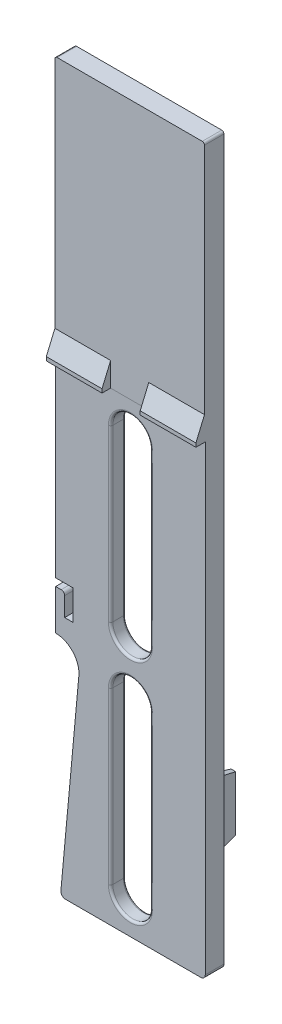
from build123d import *

# Parameters (mm, degrees)
SKETCH1_W                       = 25.4
SKETCH1_H                       = 123.19
BOSS_EXTRUDE1_DEPTH             = 2.032
SKETCH2_W                       = 25.4
SKETCH2_H                       = 123.19
SKETCH2_W_2                     = 22.352
SKETCH2_H_2                     = 120.142
EXTRUDE_THIN1_DEPTH             = 1.143
CUT_EXTRUDE1_DEPTH              = 124.883601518
LPATTERN1_COUNT                 = 2
LPATTERN1_PITCH                 = 38.608
CUT_EXTRUDE2_DEPTH              = 124.883601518
CUT_EXTRUDE2_DEPTH_BACK         = 124.883601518
CUT_EXTRUDE3_DEPTH              = 124.883601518
BOSS_EXTRUDE2_DEPTH             = 1.143
SKETCH7_W                       = 13.647669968
SKETCH7_H                       = 4.198946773
CUT_EXTRUDE4_DEPTH              = 124.883601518
CUT_EXTRUDE5_START              = -1.143
SKETCH8_R                       = 7.1374
CUT_EXTRUDE5_DEPTH              = 1.143
FILLET1_R                       = 0.254
BOSS_EXTRUDE3_DEPTH             = 0.508
BOSS_EXTRUDE4_START             = 1.143
BOSS_EXTRUDE4_DEPTH             = 1.143
SKETCH11_W                      = 1.651
SKETCH11_H                      = 49.0474
BOSS_EXTRUDE5_DEPTH             = 1.143
SKETCH12_W                      = 1.651
SKETCH12_H                      = 41.14187935
EXTRUDE_THIN4_DEPTH             = 1.143
SKETCH13_R                      = 1.392650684
SKETCH13_R_2                    = 1.442552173
BOSS_EXTRUDE6_DEPTH             = 1.143
BOSS_EXTRUDE7_DEPTH             = 1.143
FILLET2_R                       = 0.381
SKETCH15_W                      = 25.4
SKETCH15_H                      = 44.069
BOSS_EXTRUDE8_DEPTH             = 0.127
BOSS_EXTRUDE9_REACH             = 125.884
BOSS_EXTRUDE9_DIRECTION_2_REACH = 125.884
SKETCH17_W                      = 6.477
SKETCH17_H                      = 6.214678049
CUT_EXTRUDE6_DEPTH              = 124.883601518
FILLET3_R                       = 0.5842
SKETCH18_W                      = 1.651
SKETCH18_H                      = 12.7
BOSS_EXTRUDE11_DEPTH            = 6.35
BOSS_EXTRUDE11_TAPER            = 4
CUT_EXTRUDE7_DEPTH              = 127.141435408
FILLET4_R                       = 0.762
FILLET5_R                       = 0.381
CUT_EXTRUDE8_DEPTH              = 125.208662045
CUT_EXTRUDE8_DEPTH_BACK         = 125.208662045


with BuildPart() as part:
    # Sketch1 → Boss-Extrude1 (new body)
    with BuildSketch(Plane.XY):
        with Locations((0, 61.595)):
            Rectangle(SKETCH1_W, SKETCH1_H)
    extrude(amount=-BOSS_EXTRUDE1_DEPTH)

    # Sketch2 → Extrude-Thin1 (add)
    with BuildSketch(Plane(origin=(0, 0, -2.032), x_dir=(-1, 0, 0), z_dir=(0, 0, -1))):
        with Locations((0, 61.595)):
            Rectangle(SKETCH2_W, SKETCH2_H)
        with Locations((0, 61.595)):
            Rectangle(SKETCH2_W_2, SKETCH2_H_2, mode=Mode.SUBTRACT)
    extrude(amount=EXTRUDE_THIN1_DEPTH)

    # Sketch3 → Cut-Extrude1 (cut, through all)
    with BuildSketch(Plane.XY):
        with BuildLine():
            Line((3.3655, 34.7345), (3.3655, 5.8293))
            ThreePointArc((3.3655, 5.8293), (0, 2.4638), (-3.3655, 5.8293))
            Line((-3.3655, 5.8293), (-3.3655, 34.7345))
            ThreePointArc((-3.3655, 34.7345), (0, 38.1), (3.3655, 34.7345))
        make_face()
    cut_extrude1 = extrude(amount=-CUT_EXTRUDE1_DEPTH, mode=Mode.SUBTRACT)

    # LPattern1: Cut-Extrude1 ×2
    with Locations(*[(0, i * LPATTERN1_PITCH, 0) for i in range(1, LPATTERN1_COUNT)]):
        add(cut_extrude1, mode=Mode.SUBTRACT)

    # Sketch4 → Cut-Extrude2 (cut, two sides: drawn at the far end of the back side and taken through both)
    with BuildSketch(Plane.XY.offset(-CUT_EXTRUDE2_DEPTH_BACK)):
        with BuildLine():
            Line((-35.799894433, -260.142646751), (-11.8872, 0))
            Line((-11.8872, 0), (-8.763, 33.987707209))
            ThreePointArc((-8.763, 33.987707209), (-9.7792361, 37.014198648), (-12.7, 38.3032))
            Line((-12.7, 38.3032), (-273.939379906, 38.3032))
            Line((-273.939379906, 38.3032), (-682.338410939, -287.571447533))
            Line((-682.338410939, -287.571447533), (-444.198925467, -586.017294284))
            Line((-444.198925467, -586.017294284), (-35.799894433, -260.142646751))
        make_face()
    extrude(amount=CUT_EXTRUDE2_DEPTH + CUT_EXTRUDE2_DEPTH_BACK, mode=Mode.SUBTRACT)

    # Sketch5 → Cut-Extrude3 (cut, through all)
    with BuildSketch(Plane.XY):
        Polygon((-12.7, 46.4312), (-9.7282, 46.4312), (-9.7282, 41.3512), (-11.176, 41.3512), (-11.176, 45.1612), (-12.7, 45.1612), align=None)
    extrude(amount=-CUT_EXTRUDE3_DEPTH, mode=Mode.SUBTRACT)

    # Sketch6 → Boss-Extrude2 (add)
    with BuildSketch(Plane(origin=(0, 0, -2.032), x_dir=(-1, 0, 0), z_dir=(0, 0, -1))):
        with BuildLine():
            Line((-8.7884, 6.08076), (-8.7884, 72.6186))
            ThreePointArc((-8.7884, 72.6186), (0, 81.407), (8.7884, 72.6186))
            Line((8.7884, 72.6186), (8.7884, 6.08076))
            ThreePointArc((8.7884, 6.08076), (0, -2.70764), (-8.7884, 6.08076))
        make_face()
        with BuildLine():
            Line((-7.1374, 6.08076), (-7.1374, 72.6186))
            ThreePointArc((-7.1374, 72.6186), (0, 79.756), (7.1374, 72.6186))
            Line((7.1374, 72.6186), (7.1374, 6.08076))
            ThreePointArc((7.1374, 6.08076), (0, -1.05664), (-7.1374, 6.08076))
        make_face(mode=Mode.SUBTRACT)
    extrude(amount=BOSS_EXTRUDE2_DEPTH)

    # Sketch7 → Cut-Extrude4 (cut, through all)
    with BuildSketch(Plane(origin=(0, 0, -3.175), x_dir=(-1, 0, 0), z_dir=(0, 0, -1))):
        with Locations((0.47873196, -2.099473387)):
            Rectangle(SKETCH7_W, SKETCH7_H)
    extrude(amount=-CUT_EXTRUDE4_DEPTH, mode=Mode.SUBTRACT)

    # Sketch8 → Cut-Extrude5 (cut)
    with BuildSketch(Plane(origin=(0, 0, -3.175), x_dir=(-1, 0, 0), z_dir=(0, 0, -1)).offset(CUT_EXTRUDE5_START)):
        with Locations((0, 6.08076)):
            Circle(SKETCH8_R)
    extrude(amount=CUT_EXTRUDE5_DEPTH, mode=Mode.SUBTRACT)

    # Fillet1
    fillet1_edges = [part.edges().sort_by_distance(p)[0] for p in [
        (-3.737223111, 0, -2.6035),
        (3.737223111, 0, -2.6035),
    ]]
    fillet(fillet1_edges, radius=FILLET1_R)

    # Sketch9 → Boss-Extrude3 (add)
    with BuildSketch(Plane(origin=(0, 0, -2.032), x_dir=(-1, 0, 0), z_dir=(0, 0, -1))):
        with BuildLine():
            Line((-7.1374, 72.6186), (-7.1374, 6.08076))
            ThreePointArc((-7.1374, 6.08076), (-6.414276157, 2.950338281), (-4.391430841, 0.454232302))
            ThreePointArc((-4.391430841, 0.454232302), (-4.307527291, 0.171365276), (-4.547709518, 0))
            Line((-4.547709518, 0), (4.547709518, 0))
            ThreePointArc((4.547709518, 0), (4.307527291, 0.171365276), (4.391430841, 0.454232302))
            ThreePointArc((4.391430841, 0.454232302), (6.414276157, 2.950338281), (7.1374, 6.08076))
            Line((7.1374, 6.08076), (7.1374, 72.6186))
            ThreePointArc((7.1374, 72.6186), (0, 79.756), (-7.1374, 72.6186))
        make_face()
        with BuildLine():
            Line((3.3655, 34.7345), (3.3655, 5.8293))
            ThreePointArc((3.3655, 5.8293), (0, 2.4638), (-3.3655, 5.8293))
            Line((-3.3655, 5.8293), (-3.3655, 34.7345))
            ThreePointArc((-3.3655, 34.7345), (0, 38.1), (3.3655, 34.7345))
        make_face(mode=Mode.SUBTRACT)
        with BuildLine():
            Line((-3.3655, 44.4373), (-3.3655, 73.3425))
            ThreePointArc((-3.3655, 73.3425), (0, 76.708), (3.3655, 73.3425))
            Line((3.3655, 73.3425), (3.3655, 44.4373))
            ThreePointArc((3.3655, 44.4373), (0, 41.0718), (-3.3655, 44.4373))
        make_face(mode=Mode.SUBTRACT)
    extrude(amount=BOSS_EXTRUDE3_DEPTH)

    # Sketch10 → Boss-Extrude4 (add)
    with BuildSketch(Plane(origin=(0, 0, -2.032), x_dir=(-1, 0, 0), z_dir=(0, 0, -1)).offset(BOSS_EXTRUDE4_START)):
        with BuildLine():
            Line((8.7884, 34.924338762), (8.7884, 48.0822))
            Line((8.7884, 48.0822), (11.176, 48.0822))
            Line((11.176, 48.0822), (11.176, 46.4312))
            Line((11.176, 46.4312), (9.7282, 46.4312))
            Line((9.7282, 46.4312), (9.7282, 41.3512))
            Line((9.7282, 41.3512), (11.176, 41.3512))
            Line((11.176, 41.3512), (11.176, 37.997664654))
            ThreePointArc((11.176, 37.997664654), (9.577858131, 36.775126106), (8.7884, 34.924338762))
        make_face()
    extrude(amount=-BOSS_EXTRUDE4_DEPTH)

    # Sketch11 → Boss-Extrude5 (add)
    with BuildSketch(Plane(origin=(0, 0, -2.032), x_dir=(-1, 0, 0), z_dir=(0, 0, -1))):
        with Locations((7.9629, 97.1423)):
            Rectangle(SKETCH11_W, SKETCH11_H)
        with Locations((-7.9629, 97.1423)):
            Rectangle(SKETCH11_W, SKETCH11_H)
    extrude(amount=BOSS_EXTRUDE5_DEPTH)

    # Sketch12 → Extrude-Thin4 (add)
    with BuildSketch(Plane(origin=(0, 0, -2.032), x_dir=(-1, 0, 0), z_dir=(0, 0, -1))):
        with Locations((0, 101.095060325)):
            Rectangle(SKETCH12_W, SKETCH12_H)
    extrude(amount=EXTRUDE_THIN4_DEPTH)

    # Sketch13 → Boss-Extrude6 (add)
    with BuildSketch(Plane(origin=(0, 0, -2.032), x_dir=(-1, 0, 0), z_dir=(0, 0, -1))):
        with Locations((9.9822, 50.83075695)):
            Circle(SKETCH13_R)
        with Locations((-10.083369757, 49.882820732)):
            Circle(SKETCH13_R_2)
    extrude(amount=BOSS_EXTRUDE6_DEPTH)

    # Sketch14 → Boss-Extrude7 (add)
    with BuildSketch(Plane(origin=(0, 0, -2.032), x_dir=(-1, 0, 0), z_dir=(0, 0, -1))):
        with BuildLine():
            Line((7.514779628, 1.524), (11.176, 1.524))
            Line((11.176, 1.524), (11.176, 7.737039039))
            Line((11.176, 7.737039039), (8.7884, 33.711384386))
            Line((8.7884, 33.711384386), (8.7884, 6.08076))
            ThreePointArc((8.7884, 6.08076), (8.464008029, 3.715058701), (7.514779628, 1.524))
        make_face()
    extrude(amount=BOSS_EXTRUDE7_DEPTH)

    # Fillet2
    fillet2_edges = [part.edges().sort_by_distance(p)[0] for p in [
        (0, 2.4638, -2.54),
        (-3.3655, 20.2819, -2.54),
        (0, 38.1, -2.54),
        (3.3655, 20.2819, -2.54),
        (0, 41.0718, -2.54),
        (-3.3655, 58.8899, -2.54),
        (0, 76.708, -2.54),
        (3.3655, 58.8899, -2.54),
        (0, 38.1, 0),
        (-3.3655, 20.2819, 0),
        (0, 2.4638, 0),
        (3.3655, 20.2819, 0),
        (0, 76.708, 0),
        (-3.3655, 58.8899, 0),
        (0, 41.0718, 0),
        (3.3655, 58.8899, 0),
    ]]
    fillet(fillet2_edges, radius=FILLET2_R)

    # Sketch15 → Boss-Extrude8 (add)
    with BuildSketch(Plane.XY):
        with Locations((0, 101.1555)):
            Rectangle(SKETCH15_W, SKETCH15_H)
    extrude(amount=BOSS_EXTRUDE8_DEPTH)

    # Boss-Extrude9: up to this face of the body (flat: up to its plane)
    boss_extrude9_end = Plane(part.part.faces().sort_by_distance((12.7, 62.153096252, -1.564208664))[0])
    # Sketch16 → Boss-Extrude9 (add, up to the picked face)
    with BuildSketch(Plane(origin=(0, 0, 0), x_dir=(0, 0, -1), z_dir=(1, 0, 0)), mode=Mode.PRIVATE) as boss_extrude9_sk1:
        Polygon((-0.127, 79.121), (-1.5875, 79.121), (-1.5875, 79.756), (-0.127, 83.185), align=None)
    boss_extrude9_tool1 = split(extrude(boss_extrude9_sk1.sketch, amount=BOSS_EXTRUDE9_REACH, mode=Mode.PRIVATE), bisect_by=boss_extrude9_end, keep=Keep.BOTH, mode=Mode.PRIVATE)
    add(boss_extrude9_tool1.solids().sort_by(Axis((0, 80.50427, 0.679622), (1, 0, 0)))[0])

    # Boss-Extrude9 direction 2: up to this face of the body (flat: up to its plane)
    boss_extrude9_direction_2_end = Plane(part.part.faces().sort_by_distance((-12.7, 85.177532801, -1.550436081))[0])
    # Sketch16 → Boss-Extrude9 direction 2 (add, up to the picked face)
    with BuildSketch(Plane(origin=(0, 0, 0), x_dir=(0, 0, -1), z_dir=(1, 0, 0)), mode=Mode.PRIVATE) as boss_extrude9_direction_2_sk1:
        Polygon((-0.127, 79.121), (-1.5875, 79.121), (-1.5875, 79.756), (-0.127, 83.185), align=None)
    boss_extrude9_direction_2_tool1 = split(extrude(boss_extrude9_direction_2_sk1.sketch, amount=-BOSS_EXTRUDE9_DIRECTION_2_REACH, mode=Mode.PRIVATE), bisect_by=boss_extrude9_direction_2_end, keep=Keep.BOTH, mode=Mode.PRIVATE)
    add(boss_extrude9_direction_2_tool1.solids().sort_by(Axis((0, 80.50427, 0.679622), (-1, 0, 0)))[0])

    # Sketch17 → Cut-Extrude6 (cut, through all)
    with BuildSketch(Plane(origin=(0, 123.19, 0), x_dir=(1, 0, 0), z_dir=(0, 1, 0))):
        with Locations((0, -3.234339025)):
            Rectangle(SKETCH17_W, SKETCH17_H)
    extrude(amount=-CUT_EXTRUDE6_DEPTH, mode=Mode.SUBTRACT)

    # Fillet3
    fillet3_edges = [part.edges().sort_by_distance(p)[0] for p in [
        (-11.176, 45.1612, -1.5875),
    ]]
    fillet(fillet3_edges, radius=FILLET3_R)

    # Sketch18 → Boss-Extrude11 (add)
    with BuildSketch(Plane(origin=(0, 0, -3.175), x_dir=(-1, 0, 0), z_dir=(0, 0, -1))):
        with Locations((-7.9629, 19.05)):
            Rectangle(SKETCH18_W, SKETCH18_H)
    extrude(amount=BOSS_EXTRUDE11_DEPTH, taper=BOSS_EXTRUDE11_TAPER)

    # Sketch19 → Cut-Extrude7 (cut, through all)
    with BuildSketch(Plane(origin=(12.7, 0, 0), x_dir=(0, 0, -1), z_dir=(1, 0, 0))):
        Polygon((3.175, 12.7), (12.912641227, 12.7), (11.269528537, 14.868922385), align=None)
        Polygon((3.175, 25.4), (14.802583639, 25.4), (12.714688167, 22.84384826), align=None)
    extrude(amount=-CUT_EXTRUDE7_DEPTH, mode=Mode.SUBTRACT)

    # Fillet4
    fillet4_edges = [part.edges().sort_by_distance(p)[0] for p in [
        (12.7, 0, -1.5875),
        (-11.8872, 0, -1.5875),
    ]]
    fillet(fillet4_edges, radius=FILLET4_R)

    # Fillet5
    fillet5_edges = [part.edges().sort_by_distance(p)[0] for p in [
        (-12.7, 123.19, -1.524),
        (12.7, 123.19, -1.524),
    ]]
    fillet(fillet5_edges, radius=FILLET5_R)

    # Sketch20 → Cut-Extrude8 (cut, two sides: drawn at the far end of the back side and taken through both)
    with BuildSketch(Plane.XY.offset(-CUT_EXTRUDE8_DEPTH_BACK)):
        with BuildLine():
            Line((-272.278187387, 38.3032), (-12.7, 38.3032))
            ThreePointArc((-12.7, 38.3032), (-9.7792361, 37.014198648), (-8.763, 33.987707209))
            Line((-8.763, 33.987707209), (-11.810744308, 0.831750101))
            Line((-11.810744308, 0.831750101), (-35.571380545, -257.656678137))
            Line((-35.571380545, -257.656678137), (-441.005224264, -581.920058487))
            Line((-441.005224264, -581.920058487), (-677.712031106, -285.96018035))
            Line((-677.712031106, -285.96018035), (-272.278187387, 38.3032))
        make_face()
    extrude(amount=CUT_EXTRUDE8_DEPTH + CUT_EXTRUDE8_DEPTH_BACK, mode=Mode.SUBTRACT)


solid = part.part
